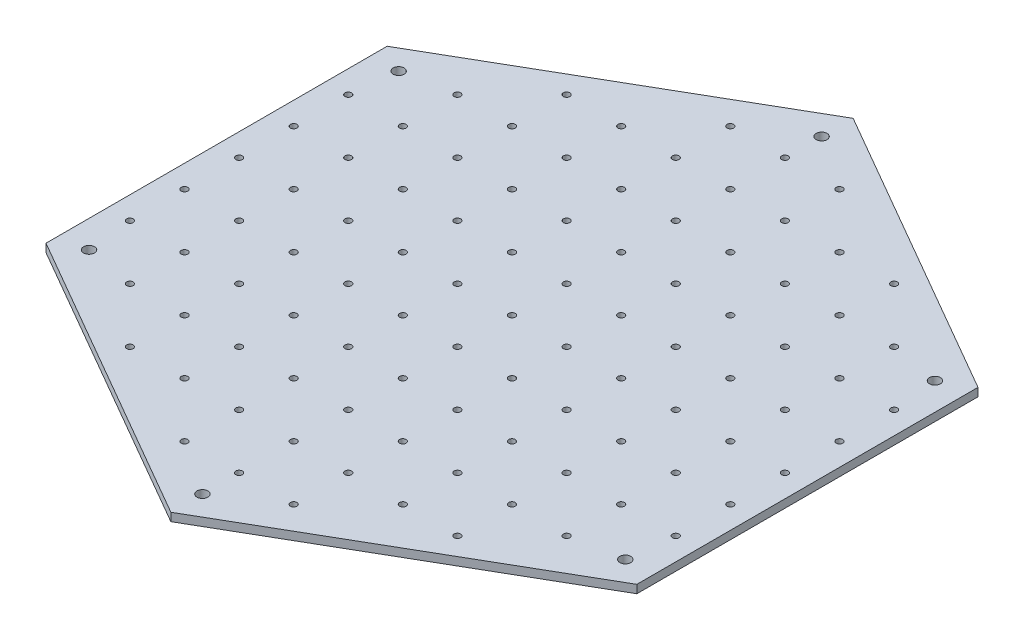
from build123d import *

# Parameters (mm, degrees)
BOSS_EXTRUDE1_DEPTH        = 1.5
SKETCH2_R                  = 0.6
CUT_EXTRUDE1_DEPTH         = 83.693334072
LPATTERN1_COUNT            = 6
LPATTERN1_PITCH            = 10
MIRROR1_COPY_1_SKETCH_R    = 0.6
MIRROR1_COPY_1_DEPTH       = 83.693334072
MIRROR1_COPY_2_SKETCH_R    = 0.6
MIRROR1_COPY_2_DEPTH       = 83.693334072
MIRROR1_COPY_3_SKETCH_R    = 0.6
MIRROR1_COPY_3_DEPTH       = 83.693334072
MIRROR1_COPY_4_SKETCH_R    = 0.6
MIRROR1_COPY_4_DEPTH       = 83.693334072
MIRROR1_COPY_5_SKETCH_R    = 0.6
MIRROR1_COPY_5_DEPTH       = 83.693334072
MIRROR1_COPY_6_SKETCH_R    = 0.6
MIRROR1_COPY_6_DEPTH       = 83.693334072
LPATTERN2_COPY_1_SKETCH_R  = 0.6
LPATTERN2_COPY_1_DEPTH     = 83.693334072
LPATTERN2_COPY_2_SKETCH_R  = 0.6
LPATTERN2_COPY_2_DEPTH     = 83.693334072
LPATTERN2_COPY_3_SKETCH_R  = 0.6
LPATTERN2_COPY_3_DEPTH     = 83.693334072
LPATTERN2_COPY_4_SKETCH_R  = 0.6
LPATTERN2_COPY_4_DEPTH     = 83.693334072
LPATTERN2_COPY_5_SKETCH_R  = 0.6
LPATTERN2_COPY_5_DEPTH     = 83.693334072
LPATTERN2_COPY_6_SKETCH_R  = 0.6
LPATTERN2_COPY_6_DEPTH     = 83.693334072
LPATTERN2_COPY_7_SKETCH_R  = 0.6
LPATTERN2_COPY_7_DEPTH     = 83.693334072
LPATTERN2_COPY_8_SKETCH_R  = 0.6
LPATTERN2_COPY_8_DEPTH     = 83.693334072
LPATTERN2_COPY_9_SKETCH_R  = 0.6
LPATTERN2_COPY_9_DEPTH     = 83.693334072
LPATTERN2_COPY_10_SKETCH_R = 0.6
LPATTERN2_COPY_10_DEPTH    = 83.693334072
LPATTERN2_COPY_11_SKETCH_R = 0.6
LPATTERN2_COPY_11_DEPTH    = 83.693334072
LPATTERN2_COPY_12_SKETCH_R = 0.6
LPATTERN2_COPY_12_DEPTH    = 83.693334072
LPATTERN2_COPY_13_SKETCH_R = 0.6
LPATTERN2_COPY_13_DEPTH    = 83.693334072
LPATTERN2_COPY_14_SKETCH_R = 0.6
LPATTERN2_COPY_14_DEPTH    = 83.693334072
LPATTERN2_COPY_15_SKETCH_R = 0.6
LPATTERN2_COPY_15_DEPTH    = 83.693334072
LPATTERN2_COPY_16_SKETCH_R = 0.6
LPATTERN2_COPY_16_DEPTH    = 83.693334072
LPATTERN2_COPY_17_SKETCH_R = 0.6
LPATTERN2_COPY_17_DEPTH    = 83.693334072
LPATTERN2_COPY_18_SKETCH_R = 0.6
LPATTERN2_COPY_18_DEPTH    = 83.693334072
LPATTERN2_COPY_19_SKETCH_R = 0.6
LPATTERN2_COPY_19_DEPTH    = 83.693334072
LPATTERN2_COPY_20_SKETCH_R = 0.6
LPATTERN2_COPY_20_DEPTH    = 83.693334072
LPATTERN2_COPY_21_SKETCH_R = 0.6
LPATTERN2_COPY_21_DEPTH    = 83.693334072
LPATTERN2_COPY_22_SKETCH_R = 0.6
LPATTERN2_COPY_22_DEPTH    = 83.693334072
LPATTERN2_COPY_23_SKETCH_R = 0.6
LPATTERN2_COPY_23_DEPTH    = 83.693334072
LPATTERN2_COPY_24_SKETCH_R = 0.6
LPATTERN2_COPY_24_DEPTH    = 83.693334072
LPATTERN2_COPY_25_SKETCH_R = 0.6
LPATTERN2_COPY_25_DEPTH    = 83.693334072
LPATTERN2_COPY_26_SKETCH_R = 0.6
LPATTERN2_COPY_26_DEPTH    = 83.693334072
LPATTERN2_COPY_27_SKETCH_R = 0.6
LPATTERN2_COPY_27_DEPTH    = 83.693334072
LPATTERN2_COPY_28_SKETCH_R = 0.6
LPATTERN2_COPY_28_DEPTH    = 83.693334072
LPATTERN2_COPY_29_SKETCH_R = 0.6
LPATTERN2_COPY_29_DEPTH    = 83.693334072
LPATTERN2_COPY_30_SKETCH_R = 0.6
LPATTERN2_COPY_30_DEPTH    = 83.693334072
LPATTERN2_COPY_31_SKETCH_R = 0.6
LPATTERN2_COPY_31_DEPTH    = 83.693334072
LPATTERN2_COPY_32_SKETCH_R = 0.6
LPATTERN2_COPY_32_DEPTH    = 83.693334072
LPATTERN2_COPY_33_SKETCH_R = 0.6
LPATTERN2_COPY_33_DEPTH    = 83.693334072
LPATTERN2_COPY_34_SKETCH_R = 0.6
LPATTERN2_COPY_34_DEPTH    = 83.693334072
LPATTERN2_COPY_35_SKETCH_R = 0.6
LPATTERN2_COPY_35_DEPTH    = 83.693334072
LPATTERN2_COPY_36_SKETCH_R = 0.6
LPATTERN2_COPY_36_DEPTH    = 83.693334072
LPATTERN2_COPY_37_SKETCH_R = 0.6
LPATTERN2_COPY_37_DEPTH    = 83.693334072
LPATTERN2_COPY_38_SKETCH_R = 0.6
LPATTERN2_COPY_38_DEPTH    = 83.693334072
LPATTERN2_COPY_39_SKETCH_R = 0.6
LPATTERN2_COPY_39_DEPTH    = 83.693334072
LPATTERN2_COPY_40_SKETCH_R = 0.6
LPATTERN2_COPY_40_DEPTH    = 83.693334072
LPATTERN2_COPY_41_SKETCH_R = 0.6
LPATTERN2_COPY_41_DEPTH    = 83.693334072
LPATTERN2_COPY_42_SKETCH_R = 0.6
LPATTERN2_COPY_42_DEPTH    = 83.693334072
LPATTERN2_COPY_43_SKETCH_R = 0.6
LPATTERN2_COPY_43_DEPTH    = 83.693334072
LPATTERN2_COPY_44_SKETCH_R = 0.6
LPATTERN2_COPY_44_DEPTH    = 83.693334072
LPATTERN2_COPY_45_SKETCH_R = 0.6
LPATTERN2_COPY_45_DEPTH    = 83.693334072
LPATTERN2_COPY_46_SKETCH_R = 0.6
LPATTERN2_COPY_46_DEPTH    = 83.693334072
LPATTERN2_COPY_47_SKETCH_R = 0.6
LPATTERN2_COPY_47_DEPTH    = 83.693334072
LPATTERN2_COPY_48_SKETCH_R = 0.6
LPATTERN2_COPY_48_DEPTH    = 83.693334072
LPATTERN2_COPY_49_SKETCH_R = 0.6
LPATTERN2_COPY_49_DEPTH    = 83.693334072
LPATTERN2_COPY_50_SKETCH_R = 0.6
LPATTERN2_COPY_50_DEPTH    = 83.693334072
LPATTERN2_COPY_51_SKETCH_R = 0.6
LPATTERN2_COPY_51_DEPTH    = 83.693334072
LPATTERN2_COPY_52_SKETCH_R = 0.6
LPATTERN2_COPY_52_DEPTH    = 83.693334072
LPATTERN2_COPY_53_SKETCH_R = 0.6
LPATTERN2_COPY_53_DEPTH    = 83.693334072
LPATTERN2_COPY_54_SKETCH_R = 0.6
LPATTERN2_COPY_54_DEPTH    = 83.693334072
LPATTERN2_COPY_55_SKETCH_R = 0.6
LPATTERN2_COPY_55_DEPTH    = 83.693334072
LPATTERN2_COPY_56_SKETCH_R = 0.6
LPATTERN2_COPY_56_DEPTH    = 83.693334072
LPATTERN2_COPY_57_SKETCH_R = 0.6
LPATTERN2_COPY_57_DEPTH    = 83.693334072
LPATTERN2_COPY_58_SKETCH_R = 0.6
LPATTERN2_COPY_58_DEPTH    = 83.693334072
LPATTERN2_COPY_59_SKETCH_R = 0.6
LPATTERN2_COPY_59_DEPTH    = 83.693334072
LPATTERN2_COPY_60_SKETCH_R = 0.6
LPATTERN2_COPY_60_DEPTH    = 83.693334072
LPATTERN2_COPY_61_SKETCH_R = 0.6
LPATTERN2_COPY_61_DEPTH    = 83.693334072
LPATTERN2_COPY_62_SKETCH_R = 0.6
LPATTERN2_COPY_62_DEPTH    = 83.693334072
LPATTERN2_COPY_63_SKETCH_R = 0.6
LPATTERN2_COPY_63_DEPTH    = 83.693334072
LPATTERN2_COPY_64_SKETCH_R = 0.6
LPATTERN2_COPY_64_DEPTH    = 83.693334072
LPATTERN2_COPY_65_SKETCH_R = 0.6
LPATTERN2_COPY_65_DEPTH    = 83.693334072
LPATTERN2_COPY_66_SKETCH_R = 0.6
LPATTERN2_COPY_66_DEPTH    = 83.693334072
LPATTERN2_COPY_67_SKETCH_R = 0.6
LPATTERN2_COPY_67_DEPTH    = 83.693334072
LPATTERN2_COPY_68_SKETCH_R = 0.6
LPATTERN2_COPY_68_DEPTH    = 83.693334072
LPATTERN2_COPY_69_SKETCH_R = 0.6
LPATTERN2_COPY_69_DEPTH    = 83.693334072
LPATTERN2_COPY_70_SKETCH_R = 0.6
LPATTERN2_COPY_70_DEPTH    = 83.693334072
LPATTERN2_COPY_71_SKETCH_R = 0.6
LPATTERN2_COPY_71_DEPTH    = 83.693334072
LPATTERN2_COPY_72_SKETCH_R = 0.6
LPATTERN2_COPY_72_DEPTH    = 83.693334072
LPATTERN2_COPY_73_SKETCH_R = 0.6
LPATTERN2_COPY_73_DEPTH    = 83.693334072
LPATTERN2_COPY_74_SKETCH_R = 0.6
LPATTERN2_COPY_74_DEPTH    = 83.693334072
LPATTERN2_COPY_75_SKETCH_R = 0.6
LPATTERN2_COPY_75_DEPTH    = 83.693334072
LPATTERN2_COPY_76_SKETCH_R = 0.6
LPATTERN2_COPY_76_DEPTH    = 83.693334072
LPATTERN2_COPY_77_SKETCH_R = 0.6
LPATTERN2_COPY_77_DEPTH    = 83.693334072
LPATTERN2_COPY_78_SKETCH_R = 0.6
LPATTERN2_COPY_78_DEPTH    = 83.693334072
MIRROR2_COPY_1_SKETCH_R    = 0.6
MIRROR2_COPY_1_DEPTH       = 83.693334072
MIRROR2_COPY_2_SKETCH_R    = 0.6
MIRROR2_COPY_2_DEPTH       = 83.693334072
MIRROR2_COPY_3_SKETCH_R    = 0.6
MIRROR2_COPY_3_DEPTH       = 83.693334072
MIRROR2_COPY_4_SKETCH_R    = 0.6
MIRROR2_COPY_4_DEPTH       = 83.693334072
MIRROR2_COPY_5_SKETCH_R    = 0.6
MIRROR2_COPY_5_DEPTH       = 83.693334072
MIRROR2_COPY_6_SKETCH_R    = 0.6
MIRROR2_COPY_6_DEPTH       = 83.693334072
MIRROR2_COPY_7_SKETCH_R    = 0.6
MIRROR2_COPY_7_DEPTH       = 83.693334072
MIRROR2_COPY_8_SKETCH_R    = 0.6
MIRROR2_COPY_8_DEPTH       = 83.693334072
MIRROR2_COPY_9_SKETCH_R    = 0.6
MIRROR2_COPY_9_DEPTH       = 83.693334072
MIRROR2_COPY_10_SKETCH_R   = 0.6
MIRROR2_COPY_10_DEPTH      = 83.693334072
MIRROR2_COPY_11_SKETCH_R   = 0.6
MIRROR2_COPY_11_DEPTH      = 83.693334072
MIRROR2_COPY_12_SKETCH_R   = 0.6
MIRROR2_COPY_12_DEPTH      = 83.693334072
MIRROR2_COPY_13_SKETCH_R   = 0.6
MIRROR2_COPY_13_DEPTH      = 83.693334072
MIRROR2_COPY_14_SKETCH_R   = 0.6
MIRROR2_COPY_14_DEPTH      = 83.693334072
MIRROR2_COPY_15_SKETCH_R   = 0.6
MIRROR2_COPY_15_DEPTH      = 83.693334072
MIRROR2_COPY_16_SKETCH_R   = 0.6
MIRROR2_COPY_16_DEPTH      = 83.693334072
MIRROR2_COPY_17_SKETCH_R   = 0.6
MIRROR2_COPY_17_DEPTH      = 83.693334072
MIRROR2_COPY_18_SKETCH_R   = 0.6
MIRROR2_COPY_18_DEPTH      = 83.693334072
MIRROR2_COPY_19_SKETCH_R   = 0.6
MIRROR2_COPY_19_DEPTH      = 83.693334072
MIRROR2_COPY_20_SKETCH_R   = 0.6
MIRROR2_COPY_20_DEPTH      = 83.693334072
MIRROR2_COPY_21_SKETCH_R   = 0.6
MIRROR2_COPY_21_DEPTH      = 83.693334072
MIRROR2_COPY_22_SKETCH_R   = 0.6
MIRROR2_COPY_22_DEPTH      = 83.693334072
MIRROR2_COPY_23_SKETCH_R   = 0.6
MIRROR2_COPY_23_DEPTH      = 83.693334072
MIRROR2_COPY_24_SKETCH_R   = 0.6
MIRROR2_COPY_24_DEPTH      = 83.693334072
MIRROR2_COPY_25_SKETCH_R   = 0.6
MIRROR2_COPY_25_DEPTH      = 83.693334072
MIRROR2_COPY_26_SKETCH_R   = 0.6
MIRROR2_COPY_26_DEPTH      = 83.693334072
MIRROR2_COPY_27_SKETCH_R   = 0.6
MIRROR2_COPY_27_DEPTH      = 83.693334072
MIRROR2_COPY_28_SKETCH_R   = 0.6
MIRROR2_COPY_28_DEPTH      = 83.693334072
MIRROR2_COPY_29_SKETCH_R   = 0.6
MIRROR2_COPY_29_DEPTH      = 83.693334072
MIRROR2_COPY_30_SKETCH_R   = 0.6
MIRROR2_COPY_30_DEPTH      = 83.693334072
MIRROR2_COPY_31_SKETCH_R   = 0.6
MIRROR2_COPY_31_DEPTH      = 83.693334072
MIRROR2_COPY_32_SKETCH_R   = 0.6
MIRROR2_COPY_32_DEPTH      = 83.693334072
MIRROR2_COPY_33_SKETCH_R   = 0.6
MIRROR2_COPY_33_DEPTH      = 83.693334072
MIRROR2_COPY_34_SKETCH_R   = 0.6
MIRROR2_COPY_34_DEPTH      = 83.693334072
MIRROR2_COPY_35_SKETCH_R   = 0.6
MIRROR2_COPY_35_DEPTH      = 83.693334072
MIRROR2_COPY_36_SKETCH_R   = 0.6
MIRROR2_COPY_36_DEPTH      = 83.693334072
MIRROR2_COPY_37_SKETCH_R   = 0.6
MIRROR2_COPY_37_DEPTH      = 83.693334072
MIRROR2_COPY_38_SKETCH_R   = 0.6
MIRROR2_COPY_38_DEPTH      = 83.693334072
MIRROR2_COPY_39_SKETCH_R   = 0.6
MIRROR2_COPY_39_DEPTH      = 83.693334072
MIRROR2_COPY_40_SKETCH_R   = 0.6
MIRROR2_COPY_40_DEPTH      = 83.693334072
MIRROR2_COPY_41_SKETCH_R   = 0.6
MIRROR2_COPY_41_DEPTH      = 83.693334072
MIRROR2_COPY_42_SKETCH_R   = 0.6
MIRROR2_COPY_42_DEPTH      = 83.693334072
MIRROR2_COPY_43_SKETCH_R   = 0.6
MIRROR2_COPY_43_DEPTH      = 83.693334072
MIRROR2_COPY_44_SKETCH_R   = 0.6
MIRROR2_COPY_44_DEPTH      = 83.693334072
MIRROR2_COPY_45_SKETCH_R   = 0.6
MIRROR2_COPY_45_DEPTH      = 83.693334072
MIRROR2_COPY_46_SKETCH_R   = 0.6
MIRROR2_COPY_46_DEPTH      = 83.693334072
MIRROR2_COPY_47_SKETCH_R   = 0.6
MIRROR2_COPY_47_DEPTH      = 83.693334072
MIRROR2_COPY_48_SKETCH_R   = 0.6
MIRROR2_COPY_48_DEPTH      = 83.693334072
MIRROR2_COPY_49_SKETCH_R   = 0.6
MIRROR2_COPY_49_DEPTH      = 83.693334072
MIRROR2_COPY_50_SKETCH_R   = 0.6
MIRROR2_COPY_50_DEPTH      = 83.693334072
MIRROR2_COPY_51_SKETCH_R   = 0.6
MIRROR2_COPY_51_DEPTH      = 83.693334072
MIRROR2_COPY_52_SKETCH_R   = 0.6
MIRROR2_COPY_52_DEPTH      = 83.693334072
MIRROR2_COPY_53_SKETCH_R   = 0.6
MIRROR2_COPY_53_DEPTH      = 83.693334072
MIRROR2_COPY_54_SKETCH_R   = 0.6
MIRROR2_COPY_54_DEPTH      = 83.693334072
MIRROR2_COPY_55_SKETCH_R   = 0.6
MIRROR2_COPY_55_DEPTH      = 83.693334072
MIRROR2_COPY_56_SKETCH_R   = 0.6
MIRROR2_COPY_56_DEPTH      = 83.693334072
MIRROR2_COPY_57_SKETCH_R   = 0.6
MIRROR2_COPY_57_DEPTH      = 83.693334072
MIRROR2_COPY_58_SKETCH_R   = 0.6
MIRROR2_COPY_58_DEPTH      = 83.693334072
MIRROR2_COPY_59_SKETCH_R   = 0.6
MIRROR2_COPY_59_DEPTH      = 83.693334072
MIRROR2_COPY_60_SKETCH_R   = 0.6
MIRROR2_COPY_60_DEPTH      = 83.693334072
MIRROR2_COPY_61_SKETCH_R   = 0.6
MIRROR2_COPY_61_DEPTH      = 83.693334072
MIRROR2_COPY_62_SKETCH_R   = 0.6
MIRROR2_COPY_62_DEPTH      = 83.693334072
MIRROR2_COPY_63_SKETCH_R   = 0.6
MIRROR2_COPY_63_DEPTH      = 83.693334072
MIRROR2_COPY_64_SKETCH_R   = 0.6
MIRROR2_COPY_64_DEPTH      = 83.693334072
MIRROR2_COPY_65_SKETCH_R   = 0.6
MIRROR2_COPY_65_DEPTH      = 83.693334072
MIRROR2_COPY_66_SKETCH_R   = 0.6
MIRROR2_COPY_66_DEPTH      = 83.693334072
MIRROR2_COPY_67_SKETCH_R   = 0.6
MIRROR2_COPY_67_DEPTH      = 83.693334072
MIRROR2_COPY_68_SKETCH_R   = 0.6
MIRROR2_COPY_68_DEPTH      = 83.693334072
MIRROR2_COPY_69_SKETCH_R   = 0.6
MIRROR2_COPY_69_DEPTH      = 83.693334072
MIRROR2_COPY_70_SKETCH_R   = 0.6
MIRROR2_COPY_70_DEPTH      = 83.693334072
MIRROR2_COPY_71_SKETCH_R   = 0.6
MIRROR2_COPY_71_DEPTH      = 83.693334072
MIRROR2_COPY_72_SKETCH_R   = 0.6
MIRROR2_COPY_72_DEPTH      = 83.693334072
MIRROR2_COPY_73_SKETCH_R   = 0.6
MIRROR2_COPY_73_DEPTH      = 83.693334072
MIRROR2_COPY_74_SKETCH_R   = 0.6
MIRROR2_COPY_74_DEPTH      = 83.693334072
MIRROR2_COPY_75_SKETCH_R   = 0.6
MIRROR2_COPY_75_DEPTH      = 83.693334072
MIRROR2_COPY_76_SKETCH_R   = 0.6
MIRROR2_COPY_76_DEPTH      = 83.693334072
MIRROR2_COPY_77_SKETCH_R   = 0.6
MIRROR2_COPY_77_DEPTH      = 83.693334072
MIRROR2_COPY_78_SKETCH_R   = 0.6
MIRROR2_COPY_78_DEPTH      = 83.693334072
MIRROR2_COPY_79_SKETCH_R   = 0.6
MIRROR2_COPY_79_DEPTH      = 83.693334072
SKETCH4_R                  = 1
CUT_EXTRUDE3_DEPTH         = 83.693334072
BOSS_EXTRUDE2_DEPTH        = 1.5
BOSS_EXTRUDE3_DEPTH        = 1.5
BOSS_EXTRUDE4_DEPTH        = 1.5


with BuildPart() as part:
    # Sketch1 → Boss-Extrude1 (new body)
    with BuildSketch(Plane(origin=(0, 0, 0), x_dir=(1, 0, 0), z_dir=(0, 1, 0))):
        Polygon((0, 62.5), (-54.126587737, 31.25), (-54.126587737, -31.25), (0, -62.5), (54.126587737, -31.25), (54.126587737, 31.25), align=None)
    extrude(amount=BOSS_EXTRUDE1_DEPTH)

    # Sketch2 → Cut-Extrude1 (cut, through all)
    with BuildSketch(Plane(origin=(0, 1.5, 0), x_dir=(1, 0, 0), z_dir=(0, 1, 0))):
        with Locations(Location((0, 0, 0), (0, 0, 270))):
            Circle(SKETCH2_R)
    cut_extrude1 = extrude(amount=-CUT_EXTRUDE1_DEPTH, mode=Mode.SUBTRACT)

    # LPattern1: Cut-Extrude1 ×6
    with Locations(*[(-i * LPATTERN1_PITCH, 0, 0) for i in range(1, LPATTERN1_COUNT)]):
        add(cut_extrude1, mode=Mode.SUBTRACT)

    # Mirror1 copy 1 sketch → Mirror1 copy 1 (cut, through all)
    with BuildSketch(Plane(origin=(10, 1.5, 0), x_dir=(-1, 0, 0), z_dir=(0, 1, 0))):
        Circle(MIRROR1_COPY_1_SKETCH_R)
    extrude(amount=-MIRROR1_COPY_1_DEPTH, mode=Mode.SUBTRACT)

    # Mirror1 copy 2 sketch → Mirror1 copy 2 (cut, through all)
    with BuildSketch(Plane(origin=(20, 1.5, 0), x_dir=(-1, 0, 0), z_dir=(0, 1, 0))):
        Circle(MIRROR1_COPY_2_SKETCH_R)
    extrude(amount=-MIRROR1_COPY_2_DEPTH, mode=Mode.SUBTRACT)

    # Mirror1 copy 3 sketch → Mirror1 copy 3 (cut, through all)
    with BuildSketch(Plane(origin=(30, 1.5, 0), x_dir=(-1, 0, 0), z_dir=(0, 1, 0))):
        Circle(MIRROR1_COPY_3_SKETCH_R)
    extrude(amount=-MIRROR1_COPY_3_DEPTH, mode=Mode.SUBTRACT)

    # Mirror1 copy 4 sketch → Mirror1 copy 4 (cut, through all)
    with BuildSketch(Plane(origin=(40, 1.5, 0), x_dir=(-1, 0, 0), z_dir=(0, 1, 0))):
        Circle(MIRROR1_COPY_4_SKETCH_R)
    extrude(amount=-MIRROR1_COPY_4_DEPTH, mode=Mode.SUBTRACT)

    # Mirror1 copy 5 sketch → Mirror1 copy 5 (cut, through all)
    with BuildSketch(Plane(origin=(50, 1.5, 0), x_dir=(-1, 0, 0), z_dir=(0, 1, 0))):
        Circle(MIRROR1_COPY_5_SKETCH_R)
    extrude(amount=-MIRROR1_COPY_5_DEPTH, mode=Mode.SUBTRACT)

    # Mirror1 copy 6 sketch → Mirror1 copy 6 (cut, through all)
    with BuildSketch(Plane(origin=(0, 1.5, 0), x_dir=(-1, 0, 0), z_dir=(0, 1, 0))):
        Circle(MIRROR1_COPY_6_SKETCH_R)
    extrude(amount=-MIRROR1_COPY_6_DEPTH, mode=Mode.SUBTRACT)

    # LPattern2 copy 1 sketch → LPattern2 copy 1 (cut, through all)
    with BuildSketch(Plane(origin=(-10, 1.5, 10), x_dir=(1, 0, 0), z_dir=(0, 1, 0))):
        with Locations(Location((0, 0, 0), (0, 0, 270))):
            Circle(LPATTERN2_COPY_1_SKETCH_R)
    extrude(amount=-LPATTERN2_COPY_1_DEPTH, mode=Mode.SUBTRACT)

    # LPattern2 copy 2 sketch → LPattern2 copy 2 (cut, through all)
    with BuildSketch(Plane(origin=(-10, 1.5, 20), x_dir=(1, 0, 0), z_dir=(0, 1, 0))):
        with Locations(Location((0, 0, 0), (0, 0, 270))):
            Circle(LPATTERN2_COPY_2_SKETCH_R)
    extrude(amount=-LPATTERN2_COPY_2_DEPTH, mode=Mode.SUBTRACT)

    # LPattern2 copy 3 sketch → LPattern2 copy 3 (cut, through all)
    with BuildSketch(Plane(origin=(-10, 1.5, 30), x_dir=(1, 0, 0), z_dir=(0, 1, 0))):
        with Locations(Location((0, 0, 0), (0, 0, 270))):
            Circle(LPATTERN2_COPY_3_SKETCH_R)
    extrude(amount=-LPATTERN2_COPY_3_DEPTH, mode=Mode.SUBTRACT)

    # LPattern2 copy 4 sketch → LPattern2 copy 4 (cut, through all)
    with BuildSketch(Plane(origin=(-10, 1.5, 40), x_dir=(1, 0, 0), z_dir=(0, 1, 0))):
        with Locations(Location((0, 0, 0), (0, 0, 270))):
            Circle(LPATTERN2_COPY_4_SKETCH_R)
    extrude(amount=-LPATTERN2_COPY_4_DEPTH, mode=Mode.SUBTRACT)

    # LPattern2 copy 5 sketch → LPattern2 copy 5 (cut, through all)
    with BuildSketch(Plane(origin=(-10, 1.5, 50), x_dir=(1, 0, 0), z_dir=(0, 1, 0))):
        with Locations(Location((0, 0, 0), (0, 0, 270))):
            Circle(LPATTERN2_COPY_5_SKETCH_R)
    extrude(amount=-LPATTERN2_COPY_5_DEPTH, mode=Mode.SUBTRACT)

    # LPattern2 copy 6 sketch → LPattern2 copy 6 (cut, through all)
    with BuildSketch(Plane(origin=(-10, 1.5, 60), x_dir=(1, 0, 0), z_dir=(0, 1, 0))):
        with Locations(Location((0, 0, 0), (0, 0, 270))):
            Circle(LPATTERN2_COPY_6_SKETCH_R)
    extrude(amount=-LPATTERN2_COPY_6_DEPTH, mode=Mode.SUBTRACT)

    # LPattern2 copy 7 sketch → LPattern2 copy 7 (cut, through all)
    with BuildSketch(Plane(origin=(-20, 1.5, 10), x_dir=(1, 0, 0), z_dir=(0, 1, 0))):
        with Locations(Location((0, 0, 0), (0, 0, 270))):
            Circle(LPATTERN2_COPY_7_SKETCH_R)
    extrude(amount=-LPATTERN2_COPY_7_DEPTH, mode=Mode.SUBTRACT)

    # LPattern2 copy 8 sketch → LPattern2 copy 8 (cut, through all)
    with BuildSketch(Plane(origin=(-20, 1.5, 20), x_dir=(1, 0, 0), z_dir=(0, 1, 0))):
        with Locations(Location((0, 0, 0), (0, 0, 270))):
            Circle(LPATTERN2_COPY_8_SKETCH_R)
    extrude(amount=-LPATTERN2_COPY_8_DEPTH, mode=Mode.SUBTRACT)

    # LPattern2 copy 9 sketch → LPattern2 copy 9 (cut, through all)
    with BuildSketch(Plane(origin=(-20, 1.5, 30), x_dir=(1, 0, 0), z_dir=(0, 1, 0))):
        with Locations(Location((0, 0, 0), (0, 0, 270))):
            Circle(LPATTERN2_COPY_9_SKETCH_R)
    extrude(amount=-LPATTERN2_COPY_9_DEPTH, mode=Mode.SUBTRACT)

    # LPattern2 copy 10 sketch → LPattern2 copy 10 (cut, through all)
    with BuildSketch(Plane(origin=(-20, 1.5, 40), x_dir=(1, 0, 0), z_dir=(0, 1, 0))):
        with Locations(Location((0, 0, 0), (0, 0, 270))):
            Circle(LPATTERN2_COPY_10_SKETCH_R)
    extrude(amount=-LPATTERN2_COPY_10_DEPTH, mode=Mode.SUBTRACT)

    # LPattern2 copy 11 sketch → LPattern2 copy 11 (cut, through all)
    with BuildSketch(Plane(origin=(-20, 1.5, 50), x_dir=(1, 0, 0), z_dir=(0, 1, 0))):
        with Locations(Location((0, 0, 0), (0, 0, 270))):
            Circle(LPATTERN2_COPY_11_SKETCH_R)
    extrude(amount=-LPATTERN2_COPY_11_DEPTH, mode=Mode.SUBTRACT)

    # LPattern2 copy 12 sketch → LPattern2 copy 12 (cut, through all)
    with BuildSketch(Plane(origin=(-20, 1.5, 60), x_dir=(1, 0, 0), z_dir=(0, 1, 0))):
        with Locations(Location((0, 0, 0), (0, 0, 270))):
            Circle(LPATTERN2_COPY_12_SKETCH_R)
    extrude(amount=-LPATTERN2_COPY_12_DEPTH, mode=Mode.SUBTRACT)

    # LPattern2 copy 13 sketch → LPattern2 copy 13 (cut, through all)
    with BuildSketch(Plane(origin=(-30, 1.5, 10), x_dir=(1, 0, 0), z_dir=(0, 1, 0))):
        with Locations(Location((0, 0, 0), (0, 0, 270))):
            Circle(LPATTERN2_COPY_13_SKETCH_R)
    extrude(amount=-LPATTERN2_COPY_13_DEPTH, mode=Mode.SUBTRACT)

    # LPattern2 copy 14 sketch → LPattern2 copy 14 (cut, through all)
    with BuildSketch(Plane(origin=(-30, 1.5, 20), x_dir=(1, 0, 0), z_dir=(0, 1, 0))):
        with Locations(Location((0, 0, 0), (0, 0, 270))):
            Circle(LPATTERN2_COPY_14_SKETCH_R)
    extrude(amount=-LPATTERN2_COPY_14_DEPTH, mode=Mode.SUBTRACT)

    # LPattern2 copy 15 sketch → LPattern2 copy 15 (cut, through all)
    with BuildSketch(Plane(origin=(-30, 1.5, 30), x_dir=(1, 0, 0), z_dir=(0, 1, 0))):
        with Locations(Location((0, 0, 0), (0, 0, 270))):
            Circle(LPATTERN2_COPY_15_SKETCH_R)
    extrude(amount=-LPATTERN2_COPY_15_DEPTH, mode=Mode.SUBTRACT)

    # LPattern2 copy 16 sketch → LPattern2 copy 16 (cut, through all)
    with BuildSketch(Plane(origin=(-30, 1.5, 40), x_dir=(1, 0, 0), z_dir=(0, 1, 0))):
        with Locations(Location((0, 0, 0), (0, 0, 270))):
            Circle(LPATTERN2_COPY_16_SKETCH_R)
    extrude(amount=-LPATTERN2_COPY_16_DEPTH, mode=Mode.SUBTRACT)

    # LPattern2 copy 17 sketch → LPattern2 copy 17 (cut, through all)
    with BuildSketch(Plane(origin=(-30, 1.5, 50), x_dir=(1, 0, 0), z_dir=(0, 1, 0))):
        with Locations(Location((0, 0, 0), (0, 0, 270))):
            Circle(LPATTERN2_COPY_17_SKETCH_R)
    extrude(amount=-LPATTERN2_COPY_17_DEPTH, mode=Mode.SUBTRACT)

    # LPattern2 copy 18 sketch → LPattern2 copy 18 (cut, through all)
    with BuildSketch(Plane(origin=(-30, 1.5, 60), x_dir=(1, 0, 0), z_dir=(0, 1, 0))):
        with Locations(Location((0, 0, 0), (0, 0, 270))):
            Circle(LPATTERN2_COPY_18_SKETCH_R)
    extrude(amount=-LPATTERN2_COPY_18_DEPTH, mode=Mode.SUBTRACT)

    # LPattern2 copy 19 sketch → LPattern2 copy 19 (cut, through all)
    with BuildSketch(Plane(origin=(-40, 1.5, 10), x_dir=(1, 0, 0), z_dir=(0, 1, 0))):
        with Locations(Location((0, 0, 0), (0, 0, 270))):
            Circle(LPATTERN2_COPY_19_SKETCH_R)
    extrude(amount=-LPATTERN2_COPY_19_DEPTH, mode=Mode.SUBTRACT)

    # LPattern2 copy 20 sketch → LPattern2 copy 20 (cut, through all)
    with BuildSketch(Plane(origin=(-40, 1.5, 20), x_dir=(1, 0, 0), z_dir=(0, 1, 0))):
        with Locations(Location((0, 0, 0), (0, 0, 270))):
            Circle(LPATTERN2_COPY_20_SKETCH_R)
    extrude(amount=-LPATTERN2_COPY_20_DEPTH, mode=Mode.SUBTRACT)

    # LPattern2 copy 21 sketch → LPattern2 copy 21 (cut, through all)
    with BuildSketch(Plane(origin=(-40, 1.5, 30), x_dir=(1, 0, 0), z_dir=(0, 1, 0))):
        with Locations(Location((0, 0, 0), (0, 0, 270))):
            Circle(LPATTERN2_COPY_21_SKETCH_R)
    extrude(amount=-LPATTERN2_COPY_21_DEPTH, mode=Mode.SUBTRACT)

    # LPattern2 copy 22 sketch → LPattern2 copy 22 (cut, through all)
    with BuildSketch(Plane(origin=(-40, 1.5, 40), x_dir=(1, 0, 0), z_dir=(0, 1, 0))):
        with Locations(Location((0, 0, 0), (0, 0, 270))):
            Circle(LPATTERN2_COPY_22_SKETCH_R)
    extrude(amount=-LPATTERN2_COPY_22_DEPTH, mode=Mode.SUBTRACT)

    # LPattern2 copy 23 sketch → LPattern2 copy 23 (cut, through all)
    with BuildSketch(Plane(origin=(-40, 1.5, 50), x_dir=(1, 0, 0), z_dir=(0, 1, 0))):
        with Locations(Location((0, 0, 0), (0, 0, 270))):
            Circle(LPATTERN2_COPY_23_SKETCH_R)
    extrude(amount=-LPATTERN2_COPY_23_DEPTH, mode=Mode.SUBTRACT)

    # LPattern2 copy 24 sketch → LPattern2 copy 24 (cut, through all)
    with BuildSketch(Plane(origin=(-40, 1.5, 60), x_dir=(1, 0, 0), z_dir=(0, 1, 0))):
        with Locations(Location((0, 0, 0), (0, 0, 270))):
            Circle(LPATTERN2_COPY_24_SKETCH_R)
    extrude(amount=-LPATTERN2_COPY_24_DEPTH, mode=Mode.SUBTRACT)

    # LPattern2 copy 25 sketch → LPattern2 copy 25 (cut, through all)
    with BuildSketch(Plane(origin=(-50, 1.5, 10), x_dir=(1, 0, 0), z_dir=(0, 1, 0))):
        with Locations(Location((0, 0, 0), (0, 0, 270))):
            Circle(LPATTERN2_COPY_25_SKETCH_R)
    extrude(amount=-LPATTERN2_COPY_25_DEPTH, mode=Mode.SUBTRACT)

    # LPattern2 copy 26 sketch → LPattern2 copy 26 (cut, through all)
    with BuildSketch(Plane(origin=(-50, 1.5, 20), x_dir=(1, 0, 0), z_dir=(0, 1, 0))):
        with Locations(Location((0, 0, 0), (0, 0, 270))):
            Circle(LPATTERN2_COPY_26_SKETCH_R)
    extrude(amount=-LPATTERN2_COPY_26_DEPTH, mode=Mode.SUBTRACT)

    # LPattern2 copy 27 sketch → LPattern2 copy 27 (cut, through all)
    with BuildSketch(Plane(origin=(-50, 1.5, 30), x_dir=(1, 0, 0), z_dir=(0, 1, 0))):
        with Locations(Location((0, 0, 0), (0, 0, 270))):
            Circle(LPATTERN2_COPY_27_SKETCH_R)
    extrude(amount=-LPATTERN2_COPY_27_DEPTH, mode=Mode.SUBTRACT)

    # LPattern2 copy 28 sketch → LPattern2 copy 28 (cut, through all)
    with BuildSketch(Plane(origin=(-50, 1.5, 40), x_dir=(1, 0, 0), z_dir=(0, 1, 0))):
        with Locations(Location((0, 0, 0), (0, 0, 270))):
            Circle(LPATTERN2_COPY_28_SKETCH_R)
    extrude(amount=-LPATTERN2_COPY_28_DEPTH, mode=Mode.SUBTRACT)

    # LPattern2 copy 29 sketch → LPattern2 copy 29 (cut, through all)
    with BuildSketch(Plane(origin=(-50, 1.5, 50), x_dir=(1, 0, 0), z_dir=(0, 1, 0))):
        with Locations(Location((0, 0, 0), (0, 0, 270))):
            Circle(LPATTERN2_COPY_29_SKETCH_R)
    extrude(amount=-LPATTERN2_COPY_29_DEPTH, mode=Mode.SUBTRACT)

    # LPattern2 copy 30 sketch → LPattern2 copy 30 (cut, through all)
    with BuildSketch(Plane(origin=(-50, 1.5, 60), x_dir=(1, 0, 0), z_dir=(0, 1, 0))):
        with Locations(Location((0, 0, 0), (0, 0, 270))):
            Circle(LPATTERN2_COPY_30_SKETCH_R)
    extrude(amount=-LPATTERN2_COPY_30_DEPTH, mode=Mode.SUBTRACT)

    # LPattern2 copy 31 sketch → LPattern2 copy 31 (cut, through all)
    with BuildSketch(Plane(origin=(0, 1.5, 10), x_dir=(1, 0, 0), z_dir=(0, 1, 0))):
        with Locations(Location((0, 0, 0), (0, 0, 270))):
            Circle(LPATTERN2_COPY_31_SKETCH_R)
    extrude(amount=-LPATTERN2_COPY_31_DEPTH, mode=Mode.SUBTRACT)

    # LPattern2 copy 32 sketch → LPattern2 copy 32 (cut, through all)
    with BuildSketch(Plane(origin=(0, 1.5, 20), x_dir=(1, 0, 0), z_dir=(0, 1, 0))):
        with Locations(Location((0, 0, 0), (0, 0, 270))):
            Circle(LPATTERN2_COPY_32_SKETCH_R)
    extrude(amount=-LPATTERN2_COPY_32_DEPTH, mode=Mode.SUBTRACT)

    # LPattern2 copy 33 sketch → LPattern2 copy 33 (cut, through all)
    with BuildSketch(Plane(origin=(0, 1.5, 30), x_dir=(1, 0, 0), z_dir=(0, 1, 0))):
        with Locations(Location((0, 0, 0), (0, 0, 270))):
            Circle(LPATTERN2_COPY_33_SKETCH_R)
    extrude(amount=-LPATTERN2_COPY_33_DEPTH, mode=Mode.SUBTRACT)

    # LPattern2 copy 34 sketch → LPattern2 copy 34 (cut, through all)
    with BuildSketch(Plane(origin=(0, 1.5, 40), x_dir=(1, 0, 0), z_dir=(0, 1, 0))):
        with Locations(Location((0, 0, 0), (0, 0, 270))):
            Circle(LPATTERN2_COPY_34_SKETCH_R)
    extrude(amount=-LPATTERN2_COPY_34_DEPTH, mode=Mode.SUBTRACT)

    # LPattern2 copy 35 sketch → LPattern2 copy 35 (cut, through all)
    with BuildSketch(Plane(origin=(0, 1.5, 50), x_dir=(1, 0, 0), z_dir=(0, 1, 0))):
        with Locations(Location((0, 0, 0), (0, 0, 270))):
            Circle(LPATTERN2_COPY_35_SKETCH_R)
    extrude(amount=-LPATTERN2_COPY_35_DEPTH, mode=Mode.SUBTRACT)

    # LPattern2 copy 36 sketch → LPattern2 copy 36 (cut, through all)
    with BuildSketch(Plane(origin=(0, 1.5, 60), x_dir=(1, 0, 0), z_dir=(0, 1, 0))):
        with Locations(Location((0, 0, 0), (0, 0, 270))):
            Circle(LPATTERN2_COPY_36_SKETCH_R)
    extrude(amount=-LPATTERN2_COPY_36_DEPTH, mode=Mode.SUBTRACT)

    # LPattern2 copy 37 sketch → LPattern2 copy 37 (cut, through all)
    with BuildSketch(Plane(origin=(10, 1.5, 10), x_dir=(-1, 0, 0), z_dir=(0, 1, 0))):
        Circle(LPATTERN2_COPY_37_SKETCH_R)
    extrude(amount=-LPATTERN2_COPY_37_DEPTH, mode=Mode.SUBTRACT)

    # LPattern2 copy 38 sketch → LPattern2 copy 38 (cut, through all)
    with BuildSketch(Plane(origin=(10, 1.5, 20), x_dir=(-1, 0, 0), z_dir=(0, 1, 0))):
        Circle(LPATTERN2_COPY_38_SKETCH_R)
    extrude(amount=-LPATTERN2_COPY_38_DEPTH, mode=Mode.SUBTRACT)

    # LPattern2 copy 39 sketch → LPattern2 copy 39 (cut, through all)
    with BuildSketch(Plane(origin=(10, 1.5, 30), x_dir=(-1, 0, 0), z_dir=(0, 1, 0))):
        Circle(LPATTERN2_COPY_39_SKETCH_R)
    extrude(amount=-LPATTERN2_COPY_39_DEPTH, mode=Mode.SUBTRACT)

    # LPattern2 copy 40 sketch → LPattern2 copy 40 (cut, through all)
    with BuildSketch(Plane(origin=(10, 1.5, 40), x_dir=(-1, 0, 0), z_dir=(0, 1, 0))):
        Circle(LPATTERN2_COPY_40_SKETCH_R)
    extrude(amount=-LPATTERN2_COPY_40_DEPTH, mode=Mode.SUBTRACT)

    # LPattern2 copy 41 sketch → LPattern2 copy 41 (cut, through all)
    with BuildSketch(Plane(origin=(10, 1.5, 50), x_dir=(-1, 0, 0), z_dir=(0, 1, 0))):
        Circle(LPATTERN2_COPY_41_SKETCH_R)
    extrude(amount=-LPATTERN2_COPY_41_DEPTH, mode=Mode.SUBTRACT)

    # LPattern2 copy 42 sketch → LPattern2 copy 42 (cut, through all)
    with BuildSketch(Plane(origin=(10, 1.5, 60), x_dir=(-1, 0, 0), z_dir=(0, 1, 0))):
        Circle(LPATTERN2_COPY_42_SKETCH_R)
    extrude(amount=-LPATTERN2_COPY_42_DEPTH, mode=Mode.SUBTRACT)

    # LPattern2 copy 43 sketch → LPattern2 copy 43 (cut, through all)
    with BuildSketch(Plane(origin=(20, 1.5, 10), x_dir=(-1, 0, 0), z_dir=(0, 1, 0))):
        Circle(LPATTERN2_COPY_43_SKETCH_R)
    extrude(amount=-LPATTERN2_COPY_43_DEPTH, mode=Mode.SUBTRACT)

    # LPattern2 copy 44 sketch → LPattern2 copy 44 (cut, through all)
    with BuildSketch(Plane(origin=(20, 1.5, 20), x_dir=(-1, 0, 0), z_dir=(0, 1, 0))):
        Circle(LPATTERN2_COPY_44_SKETCH_R)
    extrude(amount=-LPATTERN2_COPY_44_DEPTH, mode=Mode.SUBTRACT)

    # LPattern2 copy 45 sketch → LPattern2 copy 45 (cut, through all)
    with BuildSketch(Plane(origin=(20, 1.5, 30), x_dir=(-1, 0, 0), z_dir=(0, 1, 0))):
        Circle(LPATTERN2_COPY_45_SKETCH_R)
    extrude(amount=-LPATTERN2_COPY_45_DEPTH, mode=Mode.SUBTRACT)

    # LPattern2 copy 46 sketch → LPattern2 copy 46 (cut, through all)
    with BuildSketch(Plane(origin=(20, 1.5, 40), x_dir=(-1, 0, 0), z_dir=(0, 1, 0))):
        Circle(LPATTERN2_COPY_46_SKETCH_R)
    extrude(amount=-LPATTERN2_COPY_46_DEPTH, mode=Mode.SUBTRACT)

    # LPattern2 copy 47 sketch → LPattern2 copy 47 (cut, through all)
    with BuildSketch(Plane(origin=(20, 1.5, 50), x_dir=(-1, 0, 0), z_dir=(0, 1, 0))):
        Circle(LPATTERN2_COPY_47_SKETCH_R)
    extrude(amount=-LPATTERN2_COPY_47_DEPTH, mode=Mode.SUBTRACT)

    # LPattern2 copy 48 sketch → LPattern2 copy 48 (cut, through all)
    with BuildSketch(Plane(origin=(20, 1.5, 60), x_dir=(-1, 0, 0), z_dir=(0, 1, 0))):
        Circle(LPATTERN2_COPY_48_SKETCH_R)
    extrude(amount=-LPATTERN2_COPY_48_DEPTH, mode=Mode.SUBTRACT)

    # LPattern2 copy 49 sketch → LPattern2 copy 49 (cut, through all)
    with BuildSketch(Plane(origin=(30, 1.5, 10), x_dir=(-1, 0, 0), z_dir=(0, 1, 0))):
        Circle(LPATTERN2_COPY_49_SKETCH_R)
    extrude(amount=-LPATTERN2_COPY_49_DEPTH, mode=Mode.SUBTRACT)

    # LPattern2 copy 50 sketch → LPattern2 copy 50 (cut, through all)
    with BuildSketch(Plane(origin=(30, 1.5, 20), x_dir=(-1, 0, 0), z_dir=(0, 1, 0))):
        Circle(LPATTERN2_COPY_50_SKETCH_R)
    extrude(amount=-LPATTERN2_COPY_50_DEPTH, mode=Mode.SUBTRACT)

    # LPattern2 copy 51 sketch → LPattern2 copy 51 (cut, through all)
    with BuildSketch(Plane(origin=(30, 1.5, 30), x_dir=(-1, 0, 0), z_dir=(0, 1, 0))):
        Circle(LPATTERN2_COPY_51_SKETCH_R)
    extrude(amount=-LPATTERN2_COPY_51_DEPTH, mode=Mode.SUBTRACT)

    # LPattern2 copy 52 sketch → LPattern2 copy 52 (cut, through all)
    with BuildSketch(Plane(origin=(30, 1.5, 40), x_dir=(-1, 0, 0), z_dir=(0, 1, 0))):
        Circle(LPATTERN2_COPY_52_SKETCH_R)
    extrude(amount=-LPATTERN2_COPY_52_DEPTH, mode=Mode.SUBTRACT)

    # LPattern2 copy 53 sketch → LPattern2 copy 53 (cut, through all)
    with BuildSketch(Plane(origin=(30, 1.5, 50), x_dir=(-1, 0, 0), z_dir=(0, 1, 0))):
        Circle(LPATTERN2_COPY_53_SKETCH_R)
    extrude(amount=-LPATTERN2_COPY_53_DEPTH, mode=Mode.SUBTRACT)

    # LPattern2 copy 54 sketch → LPattern2 copy 54 (cut, through all)
    with BuildSketch(Plane(origin=(30, 1.5, 60), x_dir=(-1, 0, 0), z_dir=(0, 1, 0))):
        Circle(LPATTERN2_COPY_54_SKETCH_R)
    extrude(amount=-LPATTERN2_COPY_54_DEPTH, mode=Mode.SUBTRACT)

    # LPattern2 copy 55 sketch → LPattern2 copy 55 (cut, through all)
    with BuildSketch(Plane(origin=(40, 1.5, 10), x_dir=(-1, 0, 0), z_dir=(0, 1, 0))):
        Circle(LPATTERN2_COPY_55_SKETCH_R)
    extrude(amount=-LPATTERN2_COPY_55_DEPTH, mode=Mode.SUBTRACT)

    # LPattern2 copy 56 sketch → LPattern2 copy 56 (cut, through all)
    with BuildSketch(Plane(origin=(40, 1.5, 20), x_dir=(-1, 0, 0), z_dir=(0, 1, 0))):
        Circle(LPATTERN2_COPY_56_SKETCH_R)
    extrude(amount=-LPATTERN2_COPY_56_DEPTH, mode=Mode.SUBTRACT)

    # LPattern2 copy 57 sketch → LPattern2 copy 57 (cut, through all)
    with BuildSketch(Plane(origin=(40, 1.5, 30), x_dir=(-1, 0, 0), z_dir=(0, 1, 0))):
        Circle(LPATTERN2_COPY_57_SKETCH_R)
    extrude(amount=-LPATTERN2_COPY_57_DEPTH, mode=Mode.SUBTRACT)

    # LPattern2 copy 58 sketch → LPattern2 copy 58 (cut, through all)
    with BuildSketch(Plane(origin=(40, 1.5, 40), x_dir=(-1, 0, 0), z_dir=(0, 1, 0))):
        Circle(LPATTERN2_COPY_58_SKETCH_R)
    extrude(amount=-LPATTERN2_COPY_58_DEPTH, mode=Mode.SUBTRACT)

    # LPattern2 copy 59 sketch → LPattern2 copy 59 (cut, through all)
    with BuildSketch(Plane(origin=(40, 1.5, 50), x_dir=(-1, 0, 0), z_dir=(0, 1, 0))):
        Circle(LPATTERN2_COPY_59_SKETCH_R)
    extrude(amount=-LPATTERN2_COPY_59_DEPTH, mode=Mode.SUBTRACT)

    # LPattern2 copy 60 sketch → LPattern2 copy 60 (cut, through all)
    with BuildSketch(Plane(origin=(40, 1.5, 60), x_dir=(-1, 0, 0), z_dir=(0, 1, 0))):
        Circle(LPATTERN2_COPY_60_SKETCH_R)
    extrude(amount=-LPATTERN2_COPY_60_DEPTH, mode=Mode.SUBTRACT)

    # LPattern2 copy 61 sketch → LPattern2 copy 61 (cut, through all)
    with BuildSketch(Plane(origin=(50, 1.5, 10), x_dir=(-1, 0, 0), z_dir=(0, 1, 0))):
        Circle(LPATTERN2_COPY_61_SKETCH_R)
    extrude(amount=-LPATTERN2_COPY_61_DEPTH, mode=Mode.SUBTRACT)

    # LPattern2 copy 62 sketch → LPattern2 copy 62 (cut, through all)
    with BuildSketch(Plane(origin=(50, 1.5, 20), x_dir=(-1, 0, 0), z_dir=(0, 1, 0))):
        Circle(LPATTERN2_COPY_62_SKETCH_R)
    extrude(amount=-LPATTERN2_COPY_62_DEPTH, mode=Mode.SUBTRACT)

    # LPattern2 copy 63 sketch → LPattern2 copy 63 (cut, through all)
    with BuildSketch(Plane(origin=(50, 1.5, 30), x_dir=(-1, 0, 0), z_dir=(0, 1, 0))):
        Circle(LPATTERN2_COPY_63_SKETCH_R)
    extrude(amount=-LPATTERN2_COPY_63_DEPTH, mode=Mode.SUBTRACT)

    # LPattern2 copy 64 sketch → LPattern2 copy 64 (cut, through all)
    with BuildSketch(Plane(origin=(50, 1.5, 40), x_dir=(-1, 0, 0), z_dir=(0, 1, 0))):
        Circle(LPATTERN2_COPY_64_SKETCH_R)
    extrude(amount=-LPATTERN2_COPY_64_DEPTH, mode=Mode.SUBTRACT)

    # LPattern2 copy 65 sketch → LPattern2 copy 65 (cut, through all)
    with BuildSketch(Plane(origin=(50, 1.5, 50), x_dir=(-1, 0, 0), z_dir=(0, 1, 0))):
        Circle(LPATTERN2_COPY_65_SKETCH_R)
    extrude(amount=-LPATTERN2_COPY_65_DEPTH, mode=Mode.SUBTRACT)

    # LPattern2 copy 66 sketch → LPattern2 copy 66 (cut, through all)
    with BuildSketch(Plane(origin=(50, 1.5, 60), x_dir=(-1, 0, 0), z_dir=(0, 1, 0))):
        Circle(LPATTERN2_COPY_66_SKETCH_R)
    extrude(amount=-LPATTERN2_COPY_66_DEPTH, mode=Mode.SUBTRACT)

    # LPattern2 copy 67 sketch → LPattern2 copy 67 (cut, through all)
    with BuildSketch(Plane(origin=(0, 1.5, 10), x_dir=(-1, 0, 0), z_dir=(0, 1, 0))):
        Circle(LPATTERN2_COPY_67_SKETCH_R)
    extrude(amount=-LPATTERN2_COPY_67_DEPTH, mode=Mode.SUBTRACT)

    # LPattern2 copy 68 sketch → LPattern2 copy 68 (cut, through all)
    with BuildSketch(Plane(origin=(0, 1.5, 20), x_dir=(-1, 0, 0), z_dir=(0, 1, 0))):
        Circle(LPATTERN2_COPY_68_SKETCH_R)
    extrude(amount=-LPATTERN2_COPY_68_DEPTH, mode=Mode.SUBTRACT)

    # LPattern2 copy 69 sketch → LPattern2 copy 69 (cut, through all)
    with BuildSketch(Plane(origin=(0, 1.5, 30), x_dir=(-1, 0, 0), z_dir=(0, 1, 0))):
        Circle(LPATTERN2_COPY_69_SKETCH_R)
    extrude(amount=-LPATTERN2_COPY_69_DEPTH, mode=Mode.SUBTRACT)

    # LPattern2 copy 70 sketch → LPattern2 copy 70 (cut, through all)
    with BuildSketch(Plane(origin=(0, 1.5, 40), x_dir=(-1, 0, 0), z_dir=(0, 1, 0))):
        Circle(LPATTERN2_COPY_70_SKETCH_R)
    extrude(amount=-LPATTERN2_COPY_70_DEPTH, mode=Mode.SUBTRACT)

    # LPattern2 copy 71 sketch → LPattern2 copy 71 (cut, through all)
    with BuildSketch(Plane(origin=(0, 1.5, 50), x_dir=(-1, 0, 0), z_dir=(0, 1, 0))):
        Circle(LPATTERN2_COPY_71_SKETCH_R)
    extrude(amount=-LPATTERN2_COPY_71_DEPTH, mode=Mode.SUBTRACT)

    # LPattern2 copy 72 sketch → LPattern2 copy 72 (cut, through all)
    with BuildSketch(Plane(origin=(0, 1.5, 60), x_dir=(-1, 0, 0), z_dir=(0, 1, 0))):
        Circle(LPATTERN2_COPY_72_SKETCH_R)
    extrude(amount=-LPATTERN2_COPY_72_DEPTH, mode=Mode.SUBTRACT)

    # LPattern2 copy 73 sketch → LPattern2 copy 73 (cut, through all)
    with BuildSketch(Plane(origin=(0, 1.5, 10), x_dir=(1, 0, 0), z_dir=(0, 1, 0))):
        with Locations(Location((0, 0, 0), (0, 0, 270))):
            Circle(LPATTERN2_COPY_73_SKETCH_R)
    extrude(amount=-LPATTERN2_COPY_73_DEPTH, mode=Mode.SUBTRACT)

    # LPattern2 copy 74 sketch → LPattern2 copy 74 (cut, through all)
    with BuildSketch(Plane(origin=(0, 1.5, 20), x_dir=(1, 0, 0), z_dir=(0, 1, 0))):
        with Locations(Location((0, 0, 0), (0, 0, 270))):
            Circle(LPATTERN2_COPY_74_SKETCH_R)
    extrude(amount=-LPATTERN2_COPY_74_DEPTH, mode=Mode.SUBTRACT)

    # LPattern2 copy 75 sketch → LPattern2 copy 75 (cut, through all)
    with BuildSketch(Plane(origin=(0, 1.5, 30), x_dir=(1, 0, 0), z_dir=(0, 1, 0))):
        with Locations(Location((0, 0, 0), (0, 0, 270))):
            Circle(LPATTERN2_COPY_75_SKETCH_R)
    extrude(amount=-LPATTERN2_COPY_75_DEPTH, mode=Mode.SUBTRACT)

    # LPattern2 copy 76 sketch → LPattern2 copy 76 (cut, through all)
    with BuildSketch(Plane(origin=(0, 1.5, 40), x_dir=(1, 0, 0), z_dir=(0, 1, 0))):
        with Locations(Location((0, 0, 0), (0, 0, 270))):
            Circle(LPATTERN2_COPY_76_SKETCH_R)
    extrude(amount=-LPATTERN2_COPY_76_DEPTH, mode=Mode.SUBTRACT)

    # LPattern2 copy 77 sketch → LPattern2 copy 77 (cut, through all)
    with BuildSketch(Plane(origin=(0, 1.5, 50), x_dir=(1, 0, 0), z_dir=(0, 1, 0))):
        with Locations(Location((0, 0, 0), (0, 0, 270))):
            Circle(LPATTERN2_COPY_77_SKETCH_R)
    extrude(amount=-LPATTERN2_COPY_77_DEPTH, mode=Mode.SUBTRACT)

    # LPattern2 copy 78 sketch → LPattern2 copy 78 (cut, through all)
    with BuildSketch(Plane(origin=(0, 1.5, 60), x_dir=(1, 0, 0), z_dir=(0, 1, 0))):
        with Locations(Location((0, 0, 0), (0, 0, 270))):
            Circle(LPATTERN2_COPY_78_SKETCH_R)
    extrude(amount=-LPATTERN2_COPY_78_DEPTH, mode=Mode.SUBTRACT)

    # Mirror2 copy 1 sketch → Mirror2 copy 1 (cut, through all)
    with BuildSketch(Plane(origin=(-10, 1.5, -10), x_dir=(1, 0, 0), z_dir=(0, 1, 0))):
        Circle(MIRROR2_COPY_1_SKETCH_R)
    extrude(amount=-MIRROR2_COPY_1_DEPTH, mode=Mode.SUBTRACT)

    # Mirror2 copy 2 sketch → Mirror2 copy 2 (cut, through all)
    with BuildSketch(Plane(origin=(-10, 1.5, -20), x_dir=(1, 0, 0), z_dir=(0, 1, 0))):
        Circle(MIRROR2_COPY_2_SKETCH_R)
    extrude(amount=-MIRROR2_COPY_2_DEPTH, mode=Mode.SUBTRACT)

    # Mirror2 copy 3 sketch → Mirror2 copy 3 (cut, through all)
    with BuildSketch(Plane(origin=(-10, 1.5, -30), x_dir=(1, 0, 0), z_dir=(0, 1, 0))):
        Circle(MIRROR2_COPY_3_SKETCH_R)
    extrude(amount=-MIRROR2_COPY_3_DEPTH, mode=Mode.SUBTRACT)

    # Mirror2 copy 4 sketch → Mirror2 copy 4 (cut, through all)
    with BuildSketch(Plane(origin=(-10, 1.5, -40), x_dir=(1, 0, 0), z_dir=(0, 1, 0))):
        Circle(MIRROR2_COPY_4_SKETCH_R)
    extrude(amount=-MIRROR2_COPY_4_DEPTH, mode=Mode.SUBTRACT)

    # Mirror2 copy 5 sketch → Mirror2 copy 5 (cut, through all)
    with BuildSketch(Plane(origin=(-10, 1.5, -50), x_dir=(1, 0, 0), z_dir=(0, 1, 0))):
        Circle(MIRROR2_COPY_5_SKETCH_R)
    extrude(amount=-MIRROR2_COPY_5_DEPTH, mode=Mode.SUBTRACT)

    # Mirror2 copy 6 sketch → Mirror2 copy 6 (cut, through all)
    with BuildSketch(Plane(origin=(-10, 1.5, -60), x_dir=(1, 0, 0), z_dir=(0, 1, 0))):
        Circle(MIRROR2_COPY_6_SKETCH_R)
    extrude(amount=-MIRROR2_COPY_6_DEPTH, mode=Mode.SUBTRACT)

    # Mirror2 copy 7 sketch → Mirror2 copy 7 (cut, through all)
    with BuildSketch(Plane(origin=(-20, 1.5, -10), x_dir=(1, 0, 0), z_dir=(0, 1, 0))):
        Circle(MIRROR2_COPY_7_SKETCH_R)
    extrude(amount=-MIRROR2_COPY_7_DEPTH, mode=Mode.SUBTRACT)

    # Mirror2 copy 8 sketch → Mirror2 copy 8 (cut, through all)
    with BuildSketch(Plane(origin=(-20, 1.5, -20), x_dir=(1, 0, 0), z_dir=(0, 1, 0))):
        Circle(MIRROR2_COPY_8_SKETCH_R)
    extrude(amount=-MIRROR2_COPY_8_DEPTH, mode=Mode.SUBTRACT)

    # Mirror2 copy 9 sketch → Mirror2 copy 9 (cut, through all)
    with BuildSketch(Plane(origin=(-20, 1.5, -30), x_dir=(1, 0, 0), z_dir=(0, 1, 0))):
        Circle(MIRROR2_COPY_9_SKETCH_R)
    extrude(amount=-MIRROR2_COPY_9_DEPTH, mode=Mode.SUBTRACT)

    # Mirror2 copy 10 sketch → Mirror2 copy 10 (cut, through all)
    with BuildSketch(Plane(origin=(-20, 1.5, -40), x_dir=(1, 0, 0), z_dir=(0, 1, 0))):
        Circle(MIRROR2_COPY_10_SKETCH_R)
    extrude(amount=-MIRROR2_COPY_10_DEPTH, mode=Mode.SUBTRACT)

    # Mirror2 copy 11 sketch → Mirror2 copy 11 (cut, through all)
    with BuildSketch(Plane(origin=(-20, 1.5, -50), x_dir=(1, 0, 0), z_dir=(0, 1, 0))):
        Circle(MIRROR2_COPY_11_SKETCH_R)
    extrude(amount=-MIRROR2_COPY_11_DEPTH, mode=Mode.SUBTRACT)

    # Mirror2 copy 12 sketch → Mirror2 copy 12 (cut, through all)
    with BuildSketch(Plane(origin=(-20, 1.5, -60), x_dir=(1, 0, 0), z_dir=(0, 1, 0))):
        Circle(MIRROR2_COPY_12_SKETCH_R)
    extrude(amount=-MIRROR2_COPY_12_DEPTH, mode=Mode.SUBTRACT)

    # Mirror2 copy 13 sketch → Mirror2 copy 13 (cut, through all)
    with BuildSketch(Plane(origin=(-30, 1.5, -10), x_dir=(1, 0, 0), z_dir=(0, 1, 0))):
        Circle(MIRROR2_COPY_13_SKETCH_R)
    extrude(amount=-MIRROR2_COPY_13_DEPTH, mode=Mode.SUBTRACT)

    # Mirror2 copy 14 sketch → Mirror2 copy 14 (cut, through all)
    with BuildSketch(Plane(origin=(-30, 1.5, -20), x_dir=(1, 0, 0), z_dir=(0, 1, 0))):
        Circle(MIRROR2_COPY_14_SKETCH_R)
    extrude(amount=-MIRROR2_COPY_14_DEPTH, mode=Mode.SUBTRACT)

    # Mirror2 copy 15 sketch → Mirror2 copy 15 (cut, through all)
    with BuildSketch(Plane(origin=(-30, 1.5, -30), x_dir=(1, 0, 0), z_dir=(0, 1, 0))):
        Circle(MIRROR2_COPY_15_SKETCH_R)
    extrude(amount=-MIRROR2_COPY_15_DEPTH, mode=Mode.SUBTRACT)

    # Mirror2 copy 16 sketch → Mirror2 copy 16 (cut, through all)
    with BuildSketch(Plane(origin=(-30, 1.5, -40), x_dir=(1, 0, 0), z_dir=(0, 1, 0))):
        Circle(MIRROR2_COPY_16_SKETCH_R)
    extrude(amount=-MIRROR2_COPY_16_DEPTH, mode=Mode.SUBTRACT)

    # Mirror2 copy 17 sketch → Mirror2 copy 17 (cut, through all)
    with BuildSketch(Plane(origin=(-30, 1.5, -50), x_dir=(1, 0, 0), z_dir=(0, 1, 0))):
        Circle(MIRROR2_COPY_17_SKETCH_R)
    extrude(amount=-MIRROR2_COPY_17_DEPTH, mode=Mode.SUBTRACT)

    # Mirror2 copy 18 sketch → Mirror2 copy 18 (cut, through all)
    with BuildSketch(Plane(origin=(-30, 1.5, -60), x_dir=(1, 0, 0), z_dir=(0, 1, 0))):
        Circle(MIRROR2_COPY_18_SKETCH_R)
    extrude(amount=-MIRROR2_COPY_18_DEPTH, mode=Mode.SUBTRACT)

    # Mirror2 copy 19 sketch → Mirror2 copy 19 (cut, through all)
    with BuildSketch(Plane(origin=(-40, 1.5, -10), x_dir=(1, 0, 0), z_dir=(0, 1, 0))):
        Circle(MIRROR2_COPY_19_SKETCH_R)
    extrude(amount=-MIRROR2_COPY_19_DEPTH, mode=Mode.SUBTRACT)

    # Mirror2 copy 20 sketch → Mirror2 copy 20 (cut, through all)
    with BuildSketch(Plane(origin=(-40, 1.5, -20), x_dir=(1, 0, 0), z_dir=(0, 1, 0))):
        Circle(MIRROR2_COPY_20_SKETCH_R)
    extrude(amount=-MIRROR2_COPY_20_DEPTH, mode=Mode.SUBTRACT)

    # Mirror2 copy 21 sketch → Mirror2 copy 21 (cut, through all)
    with BuildSketch(Plane(origin=(-40, 1.5, -30), x_dir=(1, 0, 0), z_dir=(0, 1, 0))):
        Circle(MIRROR2_COPY_21_SKETCH_R)
    extrude(amount=-MIRROR2_COPY_21_DEPTH, mode=Mode.SUBTRACT)

    # Mirror2 copy 22 sketch → Mirror2 copy 22 (cut, through all)
    with BuildSketch(Plane(origin=(-40, 1.5, -40), x_dir=(1, 0, 0), z_dir=(0, 1, 0))):
        Circle(MIRROR2_COPY_22_SKETCH_R)
    extrude(amount=-MIRROR2_COPY_22_DEPTH, mode=Mode.SUBTRACT)

    # Mirror2 copy 23 sketch → Mirror2 copy 23 (cut, through all)
    with BuildSketch(Plane(origin=(-40, 1.5, -50), x_dir=(1, 0, 0), z_dir=(0, 1, 0))):
        Circle(MIRROR2_COPY_23_SKETCH_R)
    extrude(amount=-MIRROR2_COPY_23_DEPTH, mode=Mode.SUBTRACT)

    # Mirror2 copy 24 sketch → Mirror2 copy 24 (cut, through all)
    with BuildSketch(Plane(origin=(-40, 1.5, -60), x_dir=(1, 0, 0), z_dir=(0, 1, 0))):
        Circle(MIRROR2_COPY_24_SKETCH_R)
    extrude(amount=-MIRROR2_COPY_24_DEPTH, mode=Mode.SUBTRACT)

    # Mirror2 copy 25 sketch → Mirror2 copy 25 (cut, through all)
    with BuildSketch(Plane(origin=(-50, 1.5, -10), x_dir=(1, 0, 0), z_dir=(0, 1, 0))):
        Circle(MIRROR2_COPY_25_SKETCH_R)
    extrude(amount=-MIRROR2_COPY_25_DEPTH, mode=Mode.SUBTRACT)

    # Mirror2 copy 26 sketch → Mirror2 copy 26 (cut, through all)
    with BuildSketch(Plane(origin=(-50, 1.5, -20), x_dir=(1, 0, 0), z_dir=(0, 1, 0))):
        Circle(MIRROR2_COPY_26_SKETCH_R)
    extrude(amount=-MIRROR2_COPY_26_DEPTH, mode=Mode.SUBTRACT)

    # Mirror2 copy 27 sketch → Mirror2 copy 27 (cut, through all)
    with BuildSketch(Plane(origin=(-50, 1.5, -30), x_dir=(1, 0, 0), z_dir=(0, 1, 0))):
        Circle(MIRROR2_COPY_27_SKETCH_R)
    extrude(amount=-MIRROR2_COPY_27_DEPTH, mode=Mode.SUBTRACT)

    # Mirror2 copy 28 sketch → Mirror2 copy 28 (cut, through all)
    with BuildSketch(Plane(origin=(-50, 1.5, -40), x_dir=(1, 0, 0), z_dir=(0, 1, 0))):
        Circle(MIRROR2_COPY_28_SKETCH_R)
    extrude(amount=-MIRROR2_COPY_28_DEPTH, mode=Mode.SUBTRACT)

    # Mirror2 copy 29 sketch → Mirror2 copy 29 (cut, through all)
    with BuildSketch(Plane(origin=(-50, 1.5, -50), x_dir=(1, 0, 0), z_dir=(0, 1, 0))):
        Circle(MIRROR2_COPY_29_SKETCH_R)
    extrude(amount=-MIRROR2_COPY_29_DEPTH, mode=Mode.SUBTRACT)

    # Mirror2 copy 30 sketch → Mirror2 copy 30 (cut, through all)
    with BuildSketch(Plane(origin=(-50, 1.5, -60), x_dir=(1, 0, 0), z_dir=(0, 1, 0))):
        Circle(MIRROR2_COPY_30_SKETCH_R)
    extrude(amount=-MIRROR2_COPY_30_DEPTH, mode=Mode.SUBTRACT)

    # Mirror2 copy 31 sketch → Mirror2 copy 31 (cut, through all)
    with BuildSketch(Plane(origin=(0, 1.5, -10), x_dir=(1, 0, 0), z_dir=(0, 1, 0))):
        Circle(MIRROR2_COPY_31_SKETCH_R)
    extrude(amount=-MIRROR2_COPY_31_DEPTH, mode=Mode.SUBTRACT)

    # Mirror2 copy 32 sketch → Mirror2 copy 32 (cut, through all)
    with BuildSketch(Plane(origin=(0, 1.5, -20), x_dir=(1, 0, 0), z_dir=(0, 1, 0))):
        Circle(MIRROR2_COPY_32_SKETCH_R)
    extrude(amount=-MIRROR2_COPY_32_DEPTH, mode=Mode.SUBTRACT)

    # Mirror2 copy 33 sketch → Mirror2 copy 33 (cut, through all)
    with BuildSketch(Plane(origin=(0, 1.5, -30), x_dir=(1, 0, 0), z_dir=(0, 1, 0))):
        Circle(MIRROR2_COPY_33_SKETCH_R)
    extrude(amount=-MIRROR2_COPY_33_DEPTH, mode=Mode.SUBTRACT)

    # Mirror2 copy 34 sketch → Mirror2 copy 34 (cut, through all)
    with BuildSketch(Plane(origin=(0, 1.5, -40), x_dir=(1, 0, 0), z_dir=(0, 1, 0))):
        Circle(MIRROR2_COPY_34_SKETCH_R)
    extrude(amount=-MIRROR2_COPY_34_DEPTH, mode=Mode.SUBTRACT)

    # Mirror2 copy 35 sketch → Mirror2 copy 35 (cut, through all)
    with BuildSketch(Plane(origin=(0, 1.5, -50), x_dir=(1, 0, 0), z_dir=(0, 1, 0))):
        Circle(MIRROR2_COPY_35_SKETCH_R)
    extrude(amount=-MIRROR2_COPY_35_DEPTH, mode=Mode.SUBTRACT)

    # Mirror2 copy 36 sketch → Mirror2 copy 36 (cut, through all)
    with BuildSketch(Plane(origin=(0, 1.5, -60), x_dir=(1, 0, 0), z_dir=(0, 1, 0))):
        Circle(MIRROR2_COPY_36_SKETCH_R)
    extrude(amount=-MIRROR2_COPY_36_DEPTH, mode=Mode.SUBTRACT)

    # Mirror2 copy 37 sketch → Mirror2 copy 37 (cut, through all)
    with BuildSketch(Plane(origin=(10, 1.5, -10), x_dir=(-1, 0, 0), z_dir=(0, 1, 0))):
        with Locations(Location((0, 0, 0), (0, 0, 270))):
            Circle(MIRROR2_COPY_37_SKETCH_R)
    extrude(amount=-MIRROR2_COPY_37_DEPTH, mode=Mode.SUBTRACT)

    # Mirror2 copy 38 sketch → Mirror2 copy 38 (cut, through all)
    with BuildSketch(Plane(origin=(10, 1.5, -20), x_dir=(-1, 0, 0), z_dir=(0, 1, 0))):
        with Locations(Location((0, 0, 0), (0, 0, 270))):
            Circle(MIRROR2_COPY_38_SKETCH_R)
    extrude(amount=-MIRROR2_COPY_38_DEPTH, mode=Mode.SUBTRACT)

    # Mirror2 copy 39 sketch → Mirror2 copy 39 (cut, through all)
    with BuildSketch(Plane(origin=(10, 1.5, -30), x_dir=(-1, 0, 0), z_dir=(0, 1, 0))):
        with Locations(Location((0, 0, 0), (0, 0, 270))):
            Circle(MIRROR2_COPY_39_SKETCH_R)
    extrude(amount=-MIRROR2_COPY_39_DEPTH, mode=Mode.SUBTRACT)

    # Mirror2 copy 40 sketch → Mirror2 copy 40 (cut, through all)
    with BuildSketch(Plane(origin=(10, 1.5, -40), x_dir=(-1, 0, 0), z_dir=(0, 1, 0))):
        with Locations(Location((0, 0, 0), (0, 0, 270))):
            Circle(MIRROR2_COPY_40_SKETCH_R)
    extrude(amount=-MIRROR2_COPY_40_DEPTH, mode=Mode.SUBTRACT)

    # Mirror2 copy 41 sketch → Mirror2 copy 41 (cut, through all)
    with BuildSketch(Plane(origin=(10, 1.5, -50), x_dir=(-1, 0, 0), z_dir=(0, 1, 0))):
        with Locations(Location((0, 0, 0), (0, 0, 270))):
            Circle(MIRROR2_COPY_41_SKETCH_R)
    extrude(amount=-MIRROR2_COPY_41_DEPTH, mode=Mode.SUBTRACT)

    # Mirror2 copy 42 sketch → Mirror2 copy 42 (cut, through all)
    with BuildSketch(Plane(origin=(10, 1.5, -60), x_dir=(-1, 0, 0), z_dir=(0, 1, 0))):
        with Locations(Location((0, 0, 0), (0, 0, 270))):
            Circle(MIRROR2_COPY_42_SKETCH_R)
    extrude(amount=-MIRROR2_COPY_42_DEPTH, mode=Mode.SUBTRACT)

    # Mirror2 copy 43 sketch → Mirror2 copy 43 (cut, through all)
    with BuildSketch(Plane(origin=(20, 1.5, -10), x_dir=(-1, 0, 0), z_dir=(0, 1, 0))):
        with Locations(Location((0, 0, 0), (0, 0, 270))):
            Circle(MIRROR2_COPY_43_SKETCH_R)
    extrude(amount=-MIRROR2_COPY_43_DEPTH, mode=Mode.SUBTRACT)

    # Mirror2 copy 44 sketch → Mirror2 copy 44 (cut, through all)
    with BuildSketch(Plane(origin=(20, 1.5, -20), x_dir=(-1, 0, 0), z_dir=(0, 1, 0))):
        with Locations(Location((0, 0, 0), (0, 0, 270))):
            Circle(MIRROR2_COPY_44_SKETCH_R)
    extrude(amount=-MIRROR2_COPY_44_DEPTH, mode=Mode.SUBTRACT)

    # Mirror2 copy 45 sketch → Mirror2 copy 45 (cut, through all)
    with BuildSketch(Plane(origin=(20, 1.5, -30), x_dir=(-1, 0, 0), z_dir=(0, 1, 0))):
        with Locations(Location((0, 0, 0), (0, 0, 270))):
            Circle(MIRROR2_COPY_45_SKETCH_R)
    extrude(amount=-MIRROR2_COPY_45_DEPTH, mode=Mode.SUBTRACT)

    # Mirror2 copy 46 sketch → Mirror2 copy 46 (cut, through all)
    with BuildSketch(Plane(origin=(20, 1.5, -40), x_dir=(-1, 0, 0), z_dir=(0, 1, 0))):
        with Locations(Location((0, 0, 0), (0, 0, 270))):
            Circle(MIRROR2_COPY_46_SKETCH_R)
    extrude(amount=-MIRROR2_COPY_46_DEPTH, mode=Mode.SUBTRACT)

    # Mirror2 copy 47 sketch → Mirror2 copy 47 (cut, through all)
    with BuildSketch(Plane(origin=(20, 1.5, -50), x_dir=(-1, 0, 0), z_dir=(0, 1, 0))):
        with Locations(Location((0, 0, 0), (0, 0, 270))):
            Circle(MIRROR2_COPY_47_SKETCH_R)
    extrude(amount=-MIRROR2_COPY_47_DEPTH, mode=Mode.SUBTRACT)

    # Mirror2 copy 48 sketch → Mirror2 copy 48 (cut, through all)
    with BuildSketch(Plane(origin=(20, 1.5, -60), x_dir=(-1, 0, 0), z_dir=(0, 1, 0))):
        with Locations(Location((0, 0, 0), (0, 0, 270))):
            Circle(MIRROR2_COPY_48_SKETCH_R)
    extrude(amount=-MIRROR2_COPY_48_DEPTH, mode=Mode.SUBTRACT)

    # Mirror2 copy 49 sketch → Mirror2 copy 49 (cut, through all)
    with BuildSketch(Plane(origin=(30, 1.5, -10), x_dir=(-1, 0, 0), z_dir=(0, 1, 0))):
        with Locations(Location((0, 0, 0), (0, 0, 270))):
            Circle(MIRROR2_COPY_49_SKETCH_R)
    extrude(amount=-MIRROR2_COPY_49_DEPTH, mode=Mode.SUBTRACT)

    # Mirror2 copy 50 sketch → Mirror2 copy 50 (cut, through all)
    with BuildSketch(Plane(origin=(30, 1.5, -20), x_dir=(-1, 0, 0), z_dir=(0, 1, 0))):
        with Locations(Location((0, 0, 0), (0, 0, 270))):
            Circle(MIRROR2_COPY_50_SKETCH_R)
    extrude(amount=-MIRROR2_COPY_50_DEPTH, mode=Mode.SUBTRACT)

    # Mirror2 copy 51 sketch → Mirror2 copy 51 (cut, through all)
    with BuildSketch(Plane(origin=(30, 1.5, -30), x_dir=(-1, 0, 0), z_dir=(0, 1, 0))):
        with Locations(Location((0, 0, 0), (0, 0, 270))):
            Circle(MIRROR2_COPY_51_SKETCH_R)
    extrude(amount=-MIRROR2_COPY_51_DEPTH, mode=Mode.SUBTRACT)

    # Mirror2 copy 52 sketch → Mirror2 copy 52 (cut, through all)
    with BuildSketch(Plane(origin=(30, 1.5, -40), x_dir=(-1, 0, 0), z_dir=(0, 1, 0))):
        with Locations(Location((0, 0, 0), (0, 0, 270))):
            Circle(MIRROR2_COPY_52_SKETCH_R)
    extrude(amount=-MIRROR2_COPY_52_DEPTH, mode=Mode.SUBTRACT)

    # Mirror2 copy 53 sketch → Mirror2 copy 53 (cut, through all)
    with BuildSketch(Plane(origin=(30, 1.5, -50), x_dir=(-1, 0, 0), z_dir=(0, 1, 0))):
        with Locations(Location((0, 0, 0), (0, 0, 270))):
            Circle(MIRROR2_COPY_53_SKETCH_R)
    extrude(amount=-MIRROR2_COPY_53_DEPTH, mode=Mode.SUBTRACT)

    # Mirror2 copy 54 sketch → Mirror2 copy 54 (cut, through all)
    with BuildSketch(Plane(origin=(30, 1.5, -60), x_dir=(-1, 0, 0), z_dir=(0, 1, 0))):
        with Locations(Location((0, 0, 0), (0, 0, 270))):
            Circle(MIRROR2_COPY_54_SKETCH_R)
    extrude(amount=-MIRROR2_COPY_54_DEPTH, mode=Mode.SUBTRACT)

    # Mirror2 copy 55 sketch → Mirror2 copy 55 (cut, through all)
    with BuildSketch(Plane(origin=(40, 1.5, -10), x_dir=(-1, 0, 0), z_dir=(0, 1, 0))):
        with Locations(Location((0, 0, 0), (0, 0, 270))):
            Circle(MIRROR2_COPY_55_SKETCH_R)
    extrude(amount=-MIRROR2_COPY_55_DEPTH, mode=Mode.SUBTRACT)

    # Mirror2 copy 56 sketch → Mirror2 copy 56 (cut, through all)
    with BuildSketch(Plane(origin=(40, 1.5, -20), x_dir=(-1, 0, 0), z_dir=(0, 1, 0))):
        with Locations(Location((0, 0, 0), (0, 0, 270))):
            Circle(MIRROR2_COPY_56_SKETCH_R)
    extrude(amount=-MIRROR2_COPY_56_DEPTH, mode=Mode.SUBTRACT)

    # Mirror2 copy 57 sketch → Mirror2 copy 57 (cut, through all)
    with BuildSketch(Plane(origin=(40, 1.5, -30), x_dir=(-1, 0, 0), z_dir=(0, 1, 0))):
        with Locations(Location((0, 0, 0), (0, 0, 270))):
            Circle(MIRROR2_COPY_57_SKETCH_R)
    extrude(amount=-MIRROR2_COPY_57_DEPTH, mode=Mode.SUBTRACT)

    # Mirror2 copy 58 sketch → Mirror2 copy 58 (cut, through all)
    with BuildSketch(Plane(origin=(40, 1.5, -40), x_dir=(-1, 0, 0), z_dir=(0, 1, 0))):
        with Locations(Location((0, 0, 0), (0, 0, 270))):
            Circle(MIRROR2_COPY_58_SKETCH_R)
    extrude(amount=-MIRROR2_COPY_58_DEPTH, mode=Mode.SUBTRACT)

    # Mirror2 copy 59 sketch → Mirror2 copy 59 (cut, through all)
    with BuildSketch(Plane(origin=(40, 1.5, -50), x_dir=(-1, 0, 0), z_dir=(0, 1, 0))):
        with Locations(Location((0, 0, 0), (0, 0, 270))):
            Circle(MIRROR2_COPY_59_SKETCH_R)
    extrude(amount=-MIRROR2_COPY_59_DEPTH, mode=Mode.SUBTRACT)

    # Mirror2 copy 60 sketch → Mirror2 copy 60 (cut, through all)
    with BuildSketch(Plane(origin=(40, 1.5, -60), x_dir=(-1, 0, 0), z_dir=(0, 1, 0))):
        with Locations(Location((0, 0, 0), (0, 0, 270))):
            Circle(MIRROR2_COPY_60_SKETCH_R)
    extrude(amount=-MIRROR2_COPY_60_DEPTH, mode=Mode.SUBTRACT)

    # Mirror2 copy 61 sketch → Mirror2 copy 61 (cut, through all)
    with BuildSketch(Plane(origin=(50, 1.5, -10), x_dir=(-1, 0, 0), z_dir=(0, 1, 0))):
        with Locations(Location((0, 0, 0), (0, 0, 270))):
            Circle(MIRROR2_COPY_61_SKETCH_R)
    extrude(amount=-MIRROR2_COPY_61_DEPTH, mode=Mode.SUBTRACT)

    # Mirror2 copy 62 sketch → Mirror2 copy 62 (cut, through all)
    with BuildSketch(Plane(origin=(50, 1.5, -20), x_dir=(-1, 0, 0), z_dir=(0, 1, 0))):
        with Locations(Location((0, 0, 0), (0, 0, 270))):
            Circle(MIRROR2_COPY_62_SKETCH_R)
    extrude(amount=-MIRROR2_COPY_62_DEPTH, mode=Mode.SUBTRACT)

    # Mirror2 copy 63 sketch → Mirror2 copy 63 (cut, through all)
    with BuildSketch(Plane(origin=(50, 1.5, -30), x_dir=(-1, 0, 0), z_dir=(0, 1, 0))):
        with Locations(Location((0, 0, 0), (0, 0, 270))):
            Circle(MIRROR2_COPY_63_SKETCH_R)
    extrude(amount=-MIRROR2_COPY_63_DEPTH, mode=Mode.SUBTRACT)

    # Mirror2 copy 64 sketch → Mirror2 copy 64 (cut, through all)
    with BuildSketch(Plane(origin=(50, 1.5, -40), x_dir=(-1, 0, 0), z_dir=(0, 1, 0))):
        with Locations(Location((0, 0, 0), (0, 0, 270))):
            Circle(MIRROR2_COPY_64_SKETCH_R)
    extrude(amount=-MIRROR2_COPY_64_DEPTH, mode=Mode.SUBTRACT)

    # Mirror2 copy 65 sketch → Mirror2 copy 65 (cut, through all)
    with BuildSketch(Plane(origin=(50, 1.5, -50), x_dir=(-1, 0, 0), z_dir=(0, 1, 0))):
        with Locations(Location((0, 0, 0), (0, 0, 270))):
            Circle(MIRROR2_COPY_65_SKETCH_R)
    extrude(amount=-MIRROR2_COPY_65_DEPTH, mode=Mode.SUBTRACT)

    # Mirror2 copy 66 sketch → Mirror2 copy 66 (cut, through all)
    with BuildSketch(Plane(origin=(50, 1.5, -60), x_dir=(-1, 0, 0), z_dir=(0, 1, 0))):
        with Locations(Location((0, 0, 0), (0, 0, 270))):
            Circle(MIRROR2_COPY_66_SKETCH_R)
    extrude(amount=-MIRROR2_COPY_66_DEPTH, mode=Mode.SUBTRACT)

    # Mirror2 copy 67 sketch → Mirror2 copy 67 (cut, through all)
    with BuildSketch(Plane(origin=(0, 1.5, -10), x_dir=(-1, 0, 0), z_dir=(0, 1, 0))):
        with Locations(Location((0, 0, 0), (0, 0, 270))):
            Circle(MIRROR2_COPY_67_SKETCH_R)
    extrude(amount=-MIRROR2_COPY_67_DEPTH, mode=Mode.SUBTRACT)

    # Mirror2 copy 68 sketch → Mirror2 copy 68 (cut, through all)
    with BuildSketch(Plane(origin=(0, 1.5, -20), x_dir=(-1, 0, 0), z_dir=(0, 1, 0))):
        with Locations(Location((0, 0, 0), (0, 0, 270))):
            Circle(MIRROR2_COPY_68_SKETCH_R)
    extrude(amount=-MIRROR2_COPY_68_DEPTH, mode=Mode.SUBTRACT)

    # Mirror2 copy 69 sketch → Mirror2 copy 69 (cut, through all)
    with BuildSketch(Plane(origin=(0, 1.5, -30), x_dir=(-1, 0, 0), z_dir=(0, 1, 0))):
        with Locations(Location((0, 0, 0), (0, 0, 270))):
            Circle(MIRROR2_COPY_69_SKETCH_R)
    extrude(amount=-MIRROR2_COPY_69_DEPTH, mode=Mode.SUBTRACT)

    # Mirror2 copy 70 sketch → Mirror2 copy 70 (cut, through all)
    with BuildSketch(Plane(origin=(0, 1.5, -40), x_dir=(-1, 0, 0), z_dir=(0, 1, 0))):
        with Locations(Location((0, 0, 0), (0, 0, 270))):
            Circle(MIRROR2_COPY_70_SKETCH_R)
    extrude(amount=-MIRROR2_COPY_70_DEPTH, mode=Mode.SUBTRACT)

    # Mirror2 copy 71 sketch → Mirror2 copy 71 (cut, through all)
    with BuildSketch(Plane(origin=(0, 1.5, -50), x_dir=(-1, 0, 0), z_dir=(0, 1, 0))):
        with Locations(Location((0, 0, 0), (0, 0, 270))):
            Circle(MIRROR2_COPY_71_SKETCH_R)
    extrude(amount=-MIRROR2_COPY_71_DEPTH, mode=Mode.SUBTRACT)

    # Mirror2 copy 72 sketch → Mirror2 copy 72 (cut, through all)
    with BuildSketch(Plane(origin=(0, 1.5, -60), x_dir=(-1, 0, 0), z_dir=(0, 1, 0))):
        with Locations(Location((0, 0, 0), (0, 0, 270))):
            Circle(MIRROR2_COPY_72_SKETCH_R)
    extrude(amount=-MIRROR2_COPY_72_DEPTH, mode=Mode.SUBTRACT)

    # Mirror2 copy 73 sketch → Mirror2 copy 73 (cut, through all)
    with BuildSketch(Plane(origin=(0, 1.5, -10), x_dir=(1, 0, 0), z_dir=(0, 1, 0))):
        Circle(MIRROR2_COPY_73_SKETCH_R)
    extrude(amount=-MIRROR2_COPY_73_DEPTH, mode=Mode.SUBTRACT)

    # Mirror2 copy 74 sketch → Mirror2 copy 74 (cut, through all)
    with BuildSketch(Plane(origin=(0, 1.5, -20), x_dir=(1, 0, 0), z_dir=(0, 1, 0))):
        Circle(MIRROR2_COPY_74_SKETCH_R)
    extrude(amount=-MIRROR2_COPY_74_DEPTH, mode=Mode.SUBTRACT)

    # Mirror2 copy 75 sketch → Mirror2 copy 75 (cut, through all)
    with BuildSketch(Plane(origin=(0, 1.5, -30), x_dir=(1, 0, 0), z_dir=(0, 1, 0))):
        Circle(MIRROR2_COPY_75_SKETCH_R)
    extrude(amount=-MIRROR2_COPY_75_DEPTH, mode=Mode.SUBTRACT)

    # Mirror2 copy 76 sketch → Mirror2 copy 76 (cut, through all)
    with BuildSketch(Plane(origin=(0, 1.5, -40), x_dir=(1, 0, 0), z_dir=(0, 1, 0))):
        Circle(MIRROR2_COPY_76_SKETCH_R)
    extrude(amount=-MIRROR2_COPY_76_DEPTH, mode=Mode.SUBTRACT)

    # Mirror2 copy 77 sketch → Mirror2 copy 77 (cut, through all)
    with BuildSketch(Plane(origin=(0, 1.5, -50), x_dir=(1, 0, 0), z_dir=(0, 1, 0))):
        Circle(MIRROR2_COPY_77_SKETCH_R)
    extrude(amount=-MIRROR2_COPY_77_DEPTH, mode=Mode.SUBTRACT)

    # Mirror2 copy 78 sketch → Mirror2 copy 78 (cut, through all)
    with BuildSketch(Plane(origin=(0, 1.5, -60), x_dir=(1, 0, 0), z_dir=(0, 1, 0))):
        Circle(MIRROR2_COPY_78_SKETCH_R)
    extrude(amount=-MIRROR2_COPY_78_DEPTH, mode=Mode.SUBTRACT)

    # Mirror2 copy 79 sketch → Mirror2 copy 79 (cut, through all)
    with BuildSketch(Plane(origin=(0, 1.5, 0), x_dir=(1, 0, 0), z_dir=(0, 1, 0))):
        Circle(MIRROR2_COPY_79_SKETCH_R)
    extrude(amount=-MIRROR2_COPY_79_DEPTH, mode=Mode.SUBTRACT)

    # Sketch4 → Cut-Extrude3 (cut, through all)
    with BuildSketch(Plane(origin=(0, 1.5, 0), x_dir=(1, 0, 0), z_dir=(0, 1, 0))):
        with Locations(Location((0, 56.726497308, 0), (0, 0, 270))):
            Circle(SKETCH4_R)
        with Locations(Location((-49.126587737, 28.363248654, 0), (0, 0, 270))):
            Circle(SKETCH4_R)
        with Locations(Location((-49.126587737, -28.363248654, 0), (0, 0, 270))):
            Circle(SKETCH4_R)
        with Locations(Location((0, -56.726497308, 0), (0, 0, 270))):
            Circle(SKETCH4_R)
        with Locations(Location((49.126587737, -28.363248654, 0), (0, 0, 270))):
            Circle(SKETCH4_R)
        with Locations(Location((49.126587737, 28.363248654, 0), (0, 0, 270))):
            Circle(SKETCH4_R)
    extrude(amount=-CUT_EXTRUDE3_DEPTH, mode=Mode.SUBTRACT)

    # Sketch5 → Boss-Extrude2 (add)
    with BuildSketch(Plane(origin=(0, 1.5, 0), x_dir=(1, 0, 0), z_dir=(0, 1, 0))):
        Polygon((-54.126587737, 26.862137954), (3.8, 60.306068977), (0, 62.5), (-54.126587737, 31.25), align=None)
    extrude(amount=-BOSS_EXTRUDE2_DEPTH)

    # Sketch6 → Boss-Extrude3 (add)
    with BuildSketch(Plane(origin=(0, 1.5, 0), x_dir=(1, 0, 0), z_dir=(0, 1, 0))):
        Polygon((54.126587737, 31.25), (54.126587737, 26.862137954), (-3.8, 60.306068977), (0, 62.5), align=None)
    extrude(amount=-BOSS_EXTRUDE3_DEPTH)

    # Sketch7 → Boss-Extrude4 (add)
    with BuildSketch(Plane(origin=(0, 1.5, 0), x_dir=(1, 0, 0), z_dir=(0, 1, 0))):
        Polygon((-54.126587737, -31.25), (-54.126587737, -26.862137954), (0, -58.112137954), (54.126587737, -26.862137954), (54.126587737, -31.25), (0, -62.5), align=None)
    extrude(amount=-BOSS_EXTRUDE4_DEPTH)


solid = part.part
